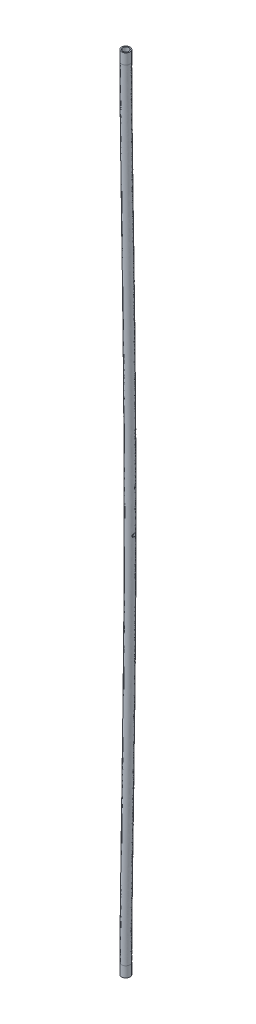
ISO-10303-21;
HEADER;
FILE_DESCRIPTION(('STEP AP214'),'2;1');
FILE_NAME('part.step','',(''),(''),'','','');
FILE_SCHEMA(('AUTOMOTIVE_DESIGN { 1 0 10303 214 1 1 1 1 }'));
ENDSEC;
DATA;
#1=APPLICATION_CONTEXT('core data for automotive mechanical design processes');
#2=APPLICATION_PROTOCOL_DEFINITION('international standard','automotive_design',2000,#1);
#3=PRODUCT_CONTEXT('',#1,'mechanical');
#4=PRODUCT('Part','Part','',(#3));
#5=PRODUCT_RELATED_PRODUCT_CATEGORY('part','',(#4));
#6=PRODUCT_DEFINITION_FORMATION('','',#4);
#7=PRODUCT_DEFINITION_CONTEXT('part definition',#1,'design');
#8=PRODUCT_DEFINITION('design','',#6,#7);
#9=PRODUCT_DEFINITION_SHAPE('','',#8);
#10=(LENGTH_UNIT() NAMED_UNIT(*) SI_UNIT(.MILLI.,.METRE.));
#11=(NAMED_UNIT(*) PLANE_ANGLE_UNIT() SI_UNIT($,.RADIAN.));
#12=(NAMED_UNIT(*) SI_UNIT($,.STERADIAN.) SOLID_ANGLE_UNIT());
#13=UNCERTAINTY_MEASURE_WITH_UNIT(LENGTH_MEASURE(1.E-05),#10,'distance_accuracy_value','');
#14=(GEOMETRIC_REPRESENTATION_CONTEXT(3) GLOBAL_UNCERTAINTY_ASSIGNED_CONTEXT((#13)) GLOBAL_UNIT_ASSIGNED_CONTEXT((#10,
#11,#12)) REPRESENTATION_CONTEXT('',''));
#15=CARTESIAN_POINT('',(0.,0.,0.));
#16=DIRECTION('',(0.,0.,1.));
#17=DIRECTION('',(1.,0.,0.));
#18=AXIS2_PLACEMENT_3D('',#15,#16,#17);
#19=CARTESIAN_POINT('',(0.,10.,4.));
#20=CARTESIAN_POINT('',(0.,28.0561455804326,4.));
#21=CARTESIAN_POINT('',(0.631904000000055,78.4560908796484,4.));
#22=CARTESIAN_POINT('',(2.41387328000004,184.166690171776,4.));
#23=CARTESIAN_POINT('',(3.746288,289.654404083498,4.));
#24=CARTESIAN_POINT('',(4.107376,374.113132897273,4.));
#25=CARTESIAN_POINT('',(3.83011200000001,459.667874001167,4.));
#26=CARTESIAN_POINT('',(2.59375815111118,561.259373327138,4.));
#27=CARTESIAN_POINT('',(0.693518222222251,671.463828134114,4.));
#28=CARTESIAN_POINT('',(0.,727.740513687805,4.));
#29=CARTESIAN_POINT('',(0.,750.,4.));
#30=CARTESIAN_POINT('',(-8.,10.,4.));
#31=CARTESIAN_POINT('',(-8.,28.0561455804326,4.));
#32=CARTESIAN_POINT('',(-7.36680746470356,78.6302533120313,4.));
#33=CARTESIAN_POINT('',(-5.58519706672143,184.279731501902,4.));
#34=CARTESIAN_POINT('',(-4.25349651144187,289.733651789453,4.));
#35=CARTESIAN_POINT('',(-3.89260493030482,374.117214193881,4.));
#36=CARTESIAN_POINT('',(-4.16975421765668,459.596575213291,4.));
#37=CARTESIAN_POINT('',(-5.40528032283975,561.143642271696,4.));
#38=CARTESIAN_POINT('',(-7.30519139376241,671.289707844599,4.));
#39=CARTESIAN_POINT('',(-8.,727.740513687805,4.));
#40=CARTESIAN_POINT('',(-8.,750.,4.));
#41=CARTESIAN_POINT('',(-8.,10.,-4.));
#42=CARTESIAN_POINT('',(-8.,28.0561455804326,-4.));
#43=CARTESIAN_POINT('',(-7.36680746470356,78.6302533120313,-4.));
#44=CARTESIAN_POINT('',(-5.58519706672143,184.279731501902,-4.));
#45=CARTESIAN_POINT('',(-4.25349651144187,289.733651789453,-4.));
#46=CARTESIAN_POINT('',(-3.89260493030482,374.117214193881,-4.));
#47=CARTESIAN_POINT('',(-4.16975421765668,459.596575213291,-4.));
#48=CARTESIAN_POINT('',(-5.40528032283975,561.143642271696,-4.));
#49=CARTESIAN_POINT('',(-7.30519139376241,671.289707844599,-4.));
#50=CARTESIAN_POINT('',(-8.,727.740513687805,-4.));
#51=CARTESIAN_POINT('',(-8.,750.,-4.));
#52=CARTESIAN_POINT('',(0.,10.,-4.));
#53=CARTESIAN_POINT('',(0.,28.0561455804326,-4.));
#54=CARTESIAN_POINT('',(0.631904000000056,78.4560908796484,-4.));
#55=CARTESIAN_POINT('',(2.41387328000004,184.166690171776,-4.));
#56=CARTESIAN_POINT('',(3.746288,289.654404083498,-4.));
#57=CARTESIAN_POINT('',(4.107376,374.113132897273,-4.));
#58=CARTESIAN_POINT('',(3.83011200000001,459.667874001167,-4.));
#59=CARTESIAN_POINT('',(2.59375815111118,561.259373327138,-4.));
#60=CARTESIAN_POINT('',(0.693518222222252,671.463828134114,-4.));
#61=CARTESIAN_POINT('',(0.,727.740513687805,-4.));
#62=CARTESIAN_POINT('',(0.,750.,-4.));
#63=CARTESIAN_POINT('',(8.,10.,-4.));
#64=CARTESIAN_POINT('',(8.,28.0561455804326,-4.));
#65=CARTESIAN_POINT('',(8.63061546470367,78.2819284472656,-4.));
#66=CARTESIAN_POINT('',(10.4129436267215,184.05364884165,-4.));
#67=CARTESIAN_POINT('',(11.7460725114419,289.575156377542,-4.));
#68=CARTESIAN_POINT('',(12.1073569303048,374.109051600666,-4.));
#69=CARTESIAN_POINT('',(11.8299782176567,459.739172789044,-4.));
#70=CARTESIAN_POINT('',(10.5927966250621,561.375104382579,-4.));
#71=CARTESIAN_POINT('',(8.69222783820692,671.637948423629,-4.));
#72=CARTESIAN_POINT('',(8.,727.740513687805,-4.));
#73=CARTESIAN_POINT('',(8.,750.,-4.));
#74=CARTESIAN_POINT('',(8.,10.,4.));
#75=CARTESIAN_POINT('',(8.,28.0561455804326,4.));
#76=CARTESIAN_POINT('',(8.63061546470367,78.2819284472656,4.));
#77=CARTESIAN_POINT('',(10.4129436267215,184.05364884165,4.));
#78=CARTESIAN_POINT('',(11.7460725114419,289.575156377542,4.));
#79=CARTESIAN_POINT('',(12.1073569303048,374.109051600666,4.));
#80=CARTESIAN_POINT('',(11.8299782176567,459.739172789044,4.));
#81=CARTESIAN_POINT('',(10.5927966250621,561.375104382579,4.));
#82=CARTESIAN_POINT('',(8.69222783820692,671.637948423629,4.));
#83=CARTESIAN_POINT('',(8.,727.740513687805,4.));
#84=CARTESIAN_POINT('',(8.,750.,4.));
#85=CARTESIAN_POINT('',(0.,10.,4.));
#86=CARTESIAN_POINT('',(0.,28.0561455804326,4.));
#87=CARTESIAN_POINT('',(0.631904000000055,78.4560908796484,4.));
#88=CARTESIAN_POINT('',(2.41387328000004,184.166690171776,4.));
#89=CARTESIAN_POINT('',(3.746288,289.654404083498,4.));
#90=CARTESIAN_POINT('',(4.107376,374.113132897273,4.));
#91=CARTESIAN_POINT('',(3.83011200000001,459.667874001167,4.));
#92=CARTESIAN_POINT('',(2.59375815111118,561.259373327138,4.));
#93=CARTESIAN_POINT('',(0.693518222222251,671.463828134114,4.));
#94=CARTESIAN_POINT('',(0.,727.740513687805,4.));
#95=CARTESIAN_POINT('',(0.,750.,4.));
#96=(BOUNDED_SURFACE() B_SPLINE_SURFACE(3,3,((#19,#20,#21,#22,#23,#24,#25,#26,#27,#28,#29),(#30,
#31,#32,#33,#34,#35,#36,#37,#38,#39,#40),(#41,#42,#43,#44,#45,#46,#47,#48,#49,#50,#51),(#52,#53,
#54,#55,#56,#57,#58,#59,#60,#61,#62),(#63,#64,#65,#66,#67,#68,#69,#70,#71,#72,#73),(#74,#75,#76,
#77,#78,#79,#80,#81,#82,#83,#84),(#85,#86,#87,#88,#89,#90,#91,#92,#93,#94,#95)),.UNSPECIFIED.,
.T.,.F.,.F.) B_SPLINE_SURFACE_WITH_KNOTS((4,3,4),(4,1,1,1,1,1,1,1,4),(0.,0.5,1.),(0.,
0.140000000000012,0.28,0.42,0.500000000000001,0.56,0.706666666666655,0.853333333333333,1.),
.UNSPECIFIED.) GEOMETRIC_REPRESENTATION_ITEM() RATIONAL_B_SPLINE_SURFACE(((1.,1.,1.,1.,1.,1.,1.,
1.,1.,1.,1.),(0.333333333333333,0.333333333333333,0.333333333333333,0.333333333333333,
0.333333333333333,0.333333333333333,0.333333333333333,0.333333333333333,0.333333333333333,
0.333333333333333,0.333333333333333),(0.333333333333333,0.333333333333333,0.333333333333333,
0.333333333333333,0.333333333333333,0.333333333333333,0.333333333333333,0.333333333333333,
0.333333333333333,0.333333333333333,0.333333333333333),(1.,1.,1.,1.,1.,1.,1.,1.,1.,1.,1.),
(0.333333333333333,0.333333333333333,0.333333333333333,0.333333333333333,0.333333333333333,
0.333333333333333,0.333333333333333,0.333333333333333,0.333333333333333,0.333333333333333,
0.333333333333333),(0.333333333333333,0.333333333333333,0.333333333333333,0.333333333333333,
0.333333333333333,0.333333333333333,0.333333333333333,0.333333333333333,0.333333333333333,
0.333333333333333,0.333333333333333),(1.,1.,1.,1.,1.,1.,1.,1.,1.,1.,1.))) REPRESENTATION_ITEM('') SURFACE());
#97=CARTESIAN_POINT('',(7.61372951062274,365.,1.75));
#98=CARTESIAN_POINT('',(7.61357437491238,364.907205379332,1.74999502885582));
#99=CARTESIAN_POINT('',(7.61705078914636,364.814246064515,1.74257071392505));
#100=CARTESIAN_POINT('',(7.63079581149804,364.631049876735,1.71319310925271));
#101=CARTESIAN_POINT('',(7.64108192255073,364.540820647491,1.69120237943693));
#102=CARTESIAN_POINT('',(7.66703886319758,364.366019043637,1.63370375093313));
#103=CARTESIAN_POINT('',(7.6826863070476,364.281423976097,1.59825448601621));
#104=CARTESIAN_POINT('',(7.7088123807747,364.15998415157,1.53588780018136));
#105=CARTESIAN_POINT('',(7.71796428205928,364.120410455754,1.513564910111));
#106=CARTESIAN_POINT('',(7.73692339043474,364.043189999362,1.46597141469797));
#107=CARTESIAN_POINT('',(7.74673117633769,364.005544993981,1.44069819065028));
#108=CARTESIAN_POINT('',(7.77799331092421,363.891327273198,1.35741370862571));
#109=CARTESIAN_POINT('',(7.80016977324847,363.818461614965,1.29448288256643));
#110=CARTESIAN_POINT('',(7.84403792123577,363.683935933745,1.15745145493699));
#111=CARTESIAN_POINT('',(7.8657295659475,363.622276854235,1.08334991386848));
#112=CARTESIAN_POINT('',(7.89677297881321,363.537974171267,0.963088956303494));
#113=CARTESIAN_POINT('',(7.90709450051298,363.510704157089,0.920363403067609));
#114=CARTESIAN_POINT('',(7.92671333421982,363.45990671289,0.832577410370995));
#115=CARTESIAN_POINT('',(7.93601155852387,363.436375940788,0.787519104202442));
#116=CARTESIAN_POINT('',(7.96196710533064,363.371701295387,0.649208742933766));
#117=CARTESIAN_POINT('',(7.97670758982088,363.33641668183,0.552738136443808));
#118=CARTESIAN_POINT('',(7.99861484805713,363.284673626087,0.359950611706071));
#119=CARTESIAN_POINT('',(8.00615924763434,363.267272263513,0.263927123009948));
#120=CARTESIAN_POINT('',(8.01421896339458,363.248696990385,0.0700336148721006));
#121=CARTESIAN_POINT('',(8.0147374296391,363.247515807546,-0.0278355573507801));
#122=CARTESIAN_POINT('',(8.00889548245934,363.260959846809,-0.21567673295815));
#123=CARTESIAN_POINT('',(8.00299057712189,363.274538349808,-0.305740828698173));
#124=CARTESIAN_POINT('',(7.98560903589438,363.315299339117,-0.48216336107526));
#125=CARTESIAN_POINT('',(7.97413198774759,363.342482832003,-0.568521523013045));
#126=CARTESIAN_POINT('',(7.94648614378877,363.409979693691,-0.736661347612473));
#127=CARTESIAN_POINT('',(7.93024914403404,363.450485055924,-0.818354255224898));
#128=CARTESIAN_POINT('',(7.89464707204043,363.543276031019,-0.973998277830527));
#129=CARTESIAN_POINT('',(7.87528086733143,363.595565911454,-1.04794657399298));
#130=CARTESIAN_POINT('',(7.83360456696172,363.715052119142,-1.19198008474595));
#131=CARTESIAN_POINT('',(7.81118259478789,363.783079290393,-1.26134462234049));
#132=CARTESIAN_POINT('',(7.76700035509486,363.929803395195,-1.38801273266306));
#133=CARTESIAN_POINT('',(7.74524039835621,364.008505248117,-1.44531071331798));
#134=CARTESIAN_POINT('',(7.7040163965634,364.178164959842,-1.54832399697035));
#135=CARTESIAN_POINT('',(7.68467382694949,364.269479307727,-1.59350509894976));
#136=CARTESIAN_POINT('',(7.65196753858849,364.459487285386,-1.66754904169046));
#137=CARTESIAN_POINT('',(7.63859902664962,364.558174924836,-1.69642496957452));
#138=CARTESIAN_POINT('',(7.62057238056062,364.752829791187,-1.73509603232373));
#139=CARTESIAN_POINT('',(7.6153740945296,364.848510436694,-1.7460763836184));
#140=CARTESIAN_POINT('',(7.61274944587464,365.040464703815,-1.75216224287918));
#141=CARTESIAN_POINT('',(7.61531994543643,365.136738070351,-1.7472741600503));
#142=CARTESIAN_POINT('',(7.62738525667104,365.319709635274,-1.72284148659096));
#143=CARTESIAN_POINT('',(7.63636007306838,365.406593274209,-1.70439460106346));
#144=CARTESIAN_POINT('',(7.65955703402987,365.57593758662,-1.65486619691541));
#145=CARTESIAN_POINT('',(7.67378050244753,365.658397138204,-1.62378149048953));
#146=CARTESIAN_POINT('',(7.706652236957,365.820684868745,-1.54833648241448));
#147=CARTESIAN_POINT('',(7.72547028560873,365.900229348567,-1.50344349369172));
#148=CARTESIAN_POINT('',(7.7652056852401,366.051088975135,-1.40212990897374));
#149=CARTESIAN_POINT('',(7.78612404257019,366.122400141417,-1.34570377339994));
#150=CARTESIAN_POINT('',(7.81854929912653,366.225199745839,-1.25053543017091));
#151=CARTESIAN_POINT('',(7.83002232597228,366.260082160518,-1.2153777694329));
#152=CARTESIAN_POINT('',(7.8526882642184,366.326752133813,-1.14222447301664));
#153=CARTESIAN_POINT('',(7.86388142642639,366.358542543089,-1.10423150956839));
#154=CARTESIAN_POINT('',(7.89661584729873,366.449037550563,-0.986207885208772));
#155=CARTESIAN_POINT('',(7.91731862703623,366.502885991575,-0.902113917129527));
#156=CARTESIAN_POINT('',(7.95433425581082,366.596090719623,-0.724644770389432));
#157=CARTESIAN_POINT('',(7.97061776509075,366.63535075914,-0.631212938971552));
#158=CARTESIAN_POINT('',(7.99674548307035,366.697284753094,-0.438151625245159));
#159=CARTESIAN_POINT('',(8.00659400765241,366.719969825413,-0.338526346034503));
#160=CARTESIAN_POINT('',(8.01819971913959,366.746601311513,-0.14411618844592));
#161=CARTESIAN_POINT('',(8.0205163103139,366.751843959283,-0.0495409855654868));
#162=CARTESIAN_POINT('',(8.01839384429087,366.747009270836,0.139129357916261));
#163=CARTESIAN_POINT('',(8.01395620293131,366.736935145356,0.233224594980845));
#164=CARTESIAN_POINT('',(7.99913010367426,366.702677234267,0.414140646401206));
#165=CARTESIAN_POINT('',(7.98900095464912,366.679107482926,0.50110084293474));
#166=CARTESIAN_POINT('',(7.96395473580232,366.619233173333,0.669774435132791));
#167=CARTESIAN_POINT('',(7.94903680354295,366.582926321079,0.751486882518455));
#168=CARTESIAN_POINT('',(7.91497507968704,366.496762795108,0.911501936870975));
#169=CARTESIAN_POINT('',(7.89566845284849,366.446359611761,0.989474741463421));
#170=CARTESIAN_POINT('',(7.85505594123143,366.334201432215,1.13619698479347));
#171=CARTESIAN_POINT('',(7.833749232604,366.272441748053,1.20494259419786));
#172=CARTESIAN_POINT('',(7.78945522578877,366.133760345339,1.33675771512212));
#173=CARTESIAN_POINT('',(7.76646424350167,366.056039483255,1.39898875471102));
#174=CARTESIAN_POINT('',(7.72299198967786,365.890643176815,1.50969249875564));
#175=CARTESIAN_POINT('',(7.70251226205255,365.802961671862,1.55815676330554));
#176=CARTESIAN_POINT('',(7.66662242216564,365.619436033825,1.63977767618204));
#177=CARTESIAN_POINT('',(7.65122185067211,365.523576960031,1.67290556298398));
#178=CARTESIAN_POINT('',(7.63366004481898,365.376199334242,1.70983795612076));
#179=CARTESIAN_POINT('',(7.62873132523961,365.326523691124,1.72001858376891));
#180=CARTESIAN_POINT('',(7.62088720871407,365.226332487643,1.73604131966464));
#181=CARTESIAN_POINT('',(7.6179702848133,365.175817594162,1.74188671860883));
#182=CARTESIAN_POINT('',(7.61536113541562,365.104313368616,1.74701310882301));
#183=CARTESIAN_POINT('',(7.61478159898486,365.083471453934,1.74813250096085));
#184=CARTESIAN_POINT('',(7.61398323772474,365.041755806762,1.74962651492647));
#185=CARTESIAN_POINT('',(7.6137644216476,365.020882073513,1.75000111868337));
#186=CARTESIAN_POINT('',(7.61372951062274,365.,1.75));
#187=B_SPLINE_CURVE_WITH_KNOTS('',3,(#97,#98,#99,#100,#101,#102,#103,#104,#105,#106,#107,#108,
#109,#110,#111,#112,#113,#114,#115,#116,#117,#118,#119,#120,#121,#122,#123,#124,#125,#126,#127,
#128,#129,#130,#131,#132,#133,#134,#135,#136,#137,#138,#139,#140,#141,#142,#143,#144,#145,#146,
#147,#148,#149,#150,#151,#152,#153,#154,#155,#156,#157,#158,#159,#160,#161,#162,#163,#164,#165,
#166,#167,#168,#169,#170,#171,#172,#173,#174,#175,#176,#177,#178,#179,#180,#181,#182,#183,#184,
#185,#186),.UNSPECIFIED.,.T.,.F.,(4,2,2,2,2,2,2,2,2,2,2,2,2,2,2,2,2,2,2,2,2,2,2,2,2,2,2,2,2,2,2,
2,2,2,2,2,2,2,2,2,2,2,2,2,4),(0.,0.278299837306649,0.557317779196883,0.835133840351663,
0.974061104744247,1.11311263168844,1.40815937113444,1.70323093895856,1.85823243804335,
2.01309461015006,2.32251129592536,2.61461505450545,2.90658784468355,3.1791292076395,
3.45169073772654,3.72836640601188,4.00514242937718,4.30295265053,4.60090058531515,
4.91038164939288,5.21961395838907,5.50738377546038,5.79503737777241,6.06165986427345,
6.32834964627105,6.60699548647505,6.8857754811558,7.03813305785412,7.19034881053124,
7.49469698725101,7.80101888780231,8.10713512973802,8.38992395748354,8.67265351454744,
8.94343929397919,9.21427386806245,9.4975679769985,9.78097929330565,10.0861054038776,
10.3914181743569,10.697301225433,10.8499558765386,11.0024945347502,11.0651203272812,
11.1277476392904),.UNSPECIFIED.);
#188=CARTESIAN_POINT('',(7.61372951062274,365.,1.75));
#189=VERTEX_POINT('',#188);
#190=EDGE_CURVE('E87',#189,#189,#187,.T.);
#191=CARTESIAN_POINT('',(0.,10.,0.));
#192=DIRECTION('',(0.,1.,0.));
#193=DIRECTION('',(0.,0.,1.));
#194=AXIS2_PLACEMENT_3D('',#191,#192,#193);
#195=CIRCLE('',#194,4.);
#196=CARTESIAN_POINT('',(0.,10.,4.));
#197=VERTEX_POINT('',#196);
#198=EDGE_CURVE('E172',#197,#197,#195,.T.);
#199=CARTESIAN_POINT('',(0.,750.,0.));
#200=DIRECTION('',(0.,1.,0.));
#201=DIRECTION('',(0.,0.,1.));
#202=AXIS2_PLACEMENT_3D('',#199,#200,#201);
#203=CIRCLE('',#202,4.);
#204=CARTESIAN_POINT('',(0.,750.,4.));
#205=VERTEX_POINT('',#204);
#206=EDGE_CURVE('E176',#205,#205,#203,.T.);
#207=CARTESIAN_POINT('',(0.420022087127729,365.,1.75));
#208=CARTESIAN_POINT('',(0.420177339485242,365.092787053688,1.74999501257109));
#209=CARTESIAN_POINT('',(0.416698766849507,365.185738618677,1.74257191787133));
#210=CARTESIAN_POINT('',(0.402945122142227,365.368919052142,1.71319935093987));
#211=CARTESIAN_POINT('',(0.392652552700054,365.459140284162,1.69121248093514));
#212=CARTESIAN_POINT('',(0.366679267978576,365.63392582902,1.63372461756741));
#213=CARTESIAN_POINT('',(0.351021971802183,365.718512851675,1.59828229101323));
#214=CARTESIAN_POINT('',(0.324879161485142,365.839941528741,1.53592828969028));
#215=CARTESIAN_POINT('',(0.315721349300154,365.879511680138,1.51360999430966));
#216=CARTESIAN_POINT('',(0.296749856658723,365.956725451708,1.46602642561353));
#217=CARTESIAN_POINT('',(0.286935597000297,365.99436731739,1.44075853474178));
#218=CARTESIAN_POINT('',(0.255650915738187,366.108581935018,1.35748752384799));
#219=CARTESIAN_POINT('',(0.233457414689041,366.181447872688,1.29456509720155));
#220=CARTESIAN_POINT('',(0.189554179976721,366.315976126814,1.15755100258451));
#221=CARTESIAN_POINT('',(0.16784448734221,366.37763749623,1.08345839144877));
#222=CARTESIAN_POINT('',(0.136772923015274,366.461948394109,0.963206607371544));
#223=CARTESIAN_POINT('',(0.126441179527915,366.489223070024,0.920481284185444));
#224=CARTESIAN_POINT('',(0.106802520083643,366.540029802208,0.832694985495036));
#225=CARTESIAN_POINT('',(0.097494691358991,366.563565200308,0.787636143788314));
#226=CARTESIAN_POINT('',(0.0715117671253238,366.628253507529,0.649322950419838));
#227=CARTESIAN_POINT('',(0.056754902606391,366.663547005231,0.552848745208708));
#228=CARTESIAN_POINT('',(0.03482279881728,366.715303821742,0.360057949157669));
#229=CARTESIAN_POINT('',(0.0272691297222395,366.732711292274,0.264035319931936));
#230=CARTESIAN_POINT('',(0.0191970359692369,366.751298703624,0.0701418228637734));
#231=CARTESIAN_POINT('',(0.0186754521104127,366.752485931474,-0.0277281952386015));
#232=CARTESIAN_POINT('',(0.0245173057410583,366.739054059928,-0.215559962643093));
#233=CARTESIAN_POINT('',(0.0304240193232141,366.725483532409,-0.305613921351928));
#234=CARTESIAN_POINT('',(0.0478129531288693,366.684741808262,-0.482017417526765));
#235=CARTESIAN_POINT('',(0.0592955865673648,366.657569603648,-0.5683666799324));
#236=CARTESIAN_POINT('',(0.0869559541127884,366.590098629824,-0.736490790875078));
#237=CARTESIAN_POINT('',(0.103201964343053,366.54960784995,-0.818176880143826));
#238=CARTESIAN_POINT('',(0.138824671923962,366.45684908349,-0.973809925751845));
#239=CARTESIAN_POINT('',(0.158202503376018,366.404576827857,-1.04775406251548));
#240=CARTESIAN_POINT('',(0.199907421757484,366.285123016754,-1.19179091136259));
#241=CARTESIAN_POINT('',(0.222346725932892,366.217109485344,-1.26116209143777));
#242=CARTESIAN_POINT('',(0.266565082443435,366.070412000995,-1.38784629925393));
#243=CARTESIAN_POINT('',(0.288343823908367,365.991723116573,-1.44515372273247));
#244=CARTESIAN_POINT('',(0.329608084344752,365.822079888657,-1.5481943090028));
#245=CARTESIAN_POINT('',(0.348971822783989,365.730768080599,-1.59339204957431));
#246=CARTESIAN_POINT('',(0.381717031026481,365.540760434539,-1.66746907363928));
#247=CARTESIAN_POINT('',(0.395103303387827,365.442070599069,-1.69636146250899));
#248=CARTESIAN_POINT('',(0.413157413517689,365.247413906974,-1.73506129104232));
#249=CARTESIAN_POINT('',(0.418366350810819,365.151734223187,-1.74605519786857));
#250=CARTESIAN_POINT('',(0.421006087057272,364.959778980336,-1.75216789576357));
#251=CARTESIAN_POINT('',(0.418440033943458,364.863503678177,-1.74729311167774));
#252=CARTESIAN_POINT('',(0.4063776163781,364.680539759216,-1.72288712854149));
#253=CARTESIAN_POINT('',(0.397402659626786,364.593665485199,-1.70445565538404));
#254=CARTESIAN_POINT('',(0.374201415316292,364.424337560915,-1.6549612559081));
#255=CARTESIAN_POINT('',(0.35997380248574,364.341885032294,-1.62389514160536));
#256=CARTESIAN_POINT('',(0.327089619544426,364.179608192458,-1.54849098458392));
#257=CARTESIAN_POINT('',(0.308263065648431,364.100067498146,-1.50362030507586));
#258=CARTESIAN_POINT('',(0.268506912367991,363.949211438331,-1.40235411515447));
#259=CARTESIAN_POINT('',(0.247576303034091,363.877900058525,-1.34595305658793));
#260=CARTESIAN_POINT('',(0.215128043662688,363.775091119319,-1.25082026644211));
#261=CARTESIAN_POINT('',(0.203645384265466,363.7402017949,-1.21567202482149));
#262=CARTESIAN_POINT('',(0.180959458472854,363.673517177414,-1.14253713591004));
#263=CARTESIAN_POINT('',(0.169755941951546,363.641719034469,-1.10455316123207));
#264=CARTESIAN_POINT('',(0.136989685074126,363.55119937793,-0.986555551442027));
#265=CARTESIAN_POINT('',(0.116264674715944,363.497332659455,-0.902477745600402));
#266=CARTESIAN_POINT('',(0.0792029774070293,363.404083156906,-0.725028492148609));
#267=CARTESIAN_POINT('',(0.0628960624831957,363.364798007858,-0.631599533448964));
#268=CARTESIAN_POINT('',(0.0367259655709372,363.30281445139,-0.438537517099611));
#269=CARTESIAN_POINT('',(0.026858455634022,363.280104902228,-0.338908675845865));
#270=CARTESIAN_POINT('',(0.0152238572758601,363.253430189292,-0.144496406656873));
#271=CARTESIAN_POINT('',(0.0128961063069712,363.248166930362,-0.049923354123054));
#272=CARTESIAN_POINT('',(0.0150023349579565,363.252960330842,0.138746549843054));
#273=CARTESIAN_POINT('',(0.0194348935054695,363.263013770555,0.232843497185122));
#274=CARTESIAN_POINT('',(0.0342563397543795,363.297229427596,0.413753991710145));
#275=CARTESIAN_POINT('',(0.0443848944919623,363.320775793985,0.500707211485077));
#276=CARTESIAN_POINT('',(0.0694341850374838,363.380600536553,0.669370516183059));
#277=CARTESIAN_POINT('',(0.0843557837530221,363.416881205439,0.751079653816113));
#278=CARTESIAN_POINT('',(0.118429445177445,363.502989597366,0.911093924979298));
#279=CARTESIAN_POINT('',(0.13774461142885,363.553363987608,0.989069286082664));
#280=CARTESIAN_POINT('',(0.178378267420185,363.665462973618,1.13580165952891));
#281=CARTESIAN_POINT('',(0.199697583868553,363.727192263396,1.20455483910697));
#282=CARTESIAN_POINT('',(0.244024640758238,363.865819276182,1.33640082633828));
#283=CARTESIAN_POINT('',(0.267036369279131,363.943517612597,1.39865404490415));
#284=CARTESIAN_POINT('',(0.310552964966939,364.10887249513,1.50940642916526));
#285=CARTESIAN_POINT('',(0.331056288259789,364.196535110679,1.55789714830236));
#286=CARTESIAN_POINT('',(0.366995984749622,364.380037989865,1.63957932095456));
#287=CARTESIAN_POINT('',(0.382422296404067,364.475894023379,1.67274044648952));
#288=CARTESIAN_POINT('',(0.400019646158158,364.623273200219,1.70972194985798));
#289=CARTESIAN_POINT('',(0.40495969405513,364.672950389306,1.71991880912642));
#290=CARTESIAN_POINT('',(0.412824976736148,364.773146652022,1.73597348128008));
#291=CARTESIAN_POINT('',(0.41575173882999,364.823665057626,1.74183458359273));
#292=CARTESIAN_POINT('',(0.418376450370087,364.89525867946,1.74698852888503));
#293=CARTESIAN_POINT('',(0.418961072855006,364.916185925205,1.74811713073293));
#294=CARTESIAN_POINT('',(0.419766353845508,364.958072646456,1.74962343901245));
#295=CARTESIAN_POINT('',(0.419987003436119,364.979032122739,1.7500011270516));
#296=CARTESIAN_POINT('',(0.420022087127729,365.,1.75));
#297=B_SPLINE_CURVE_WITH_KNOTS('',3,(#207,#208,#209,#210,#211,#212,#213,#214,#215,#216,#217,
#218,#219,#220,#221,#222,#223,#224,#225,#226,#227,#228,#229,#230,#231,#232,#233,#234,#235,#236,
#237,#238,#239,#240,#241,#242,#243,#244,#245,#246,#247,#248,#249,#250,#251,#252,#253,#254,#255,
#256,#257,#258,#259,#260,#261,#262,#263,#264,#265,#266,#267,#268,#269,#270,#271,#272,#273,#274,
#275,#276,#277,#278,#279,#280,#281,#282,#283,#284,#285,#286,#287,#288,#289,#290,#291,#292,#293,
#294,#295,#296),.UNSPECIFIED.,.T.,.F.,(4,2,2,2,2,2,2,2,2,2,2,2,2,2,2,2,2,2,2,2,2,2,2,2,2,2,2,2,
2,2,2,2,2,2,2,2,2,2,2,2,2,2,2,2,4),(0.,0.278276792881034,0.557270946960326,0.835062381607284,
0.973977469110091,1.1130167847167,1.408059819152,1.70312777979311,1.85814216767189,
2.01301722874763,2.32245937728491,2.61456564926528,2.90654068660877,3.17904898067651,
3.45157747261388,3.72822103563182,4.00496500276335,4.30277307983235,4.60071920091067,
4.91022689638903,5.21948547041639,5.50725835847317,5.79491474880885,6.06150054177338,
6.32815364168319,6.60676310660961,6.88550694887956,7.03786575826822,7.19008274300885,
7.49443375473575,7.8007873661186,8.10693486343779,8.3897211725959,8.67244804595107,
8.94319551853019,9.21399176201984,9.49725186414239,9.78062932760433,10.0857588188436,
10.3910751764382,10.6969930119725,10.8496651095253,11.0022212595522,11.0651042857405,
11.1279888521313),.UNSPECIFIED.);
#298=CARTESIAN_POINT('',(0.420022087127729,365.,1.75));
#299=VERTEX_POINT('',#298);
#300=EDGE_CURVE('E11',#299,#299,#297,.T.);
#301=ORIENTED_EDGE('',*,*,#190,.F.);
#302=EDGE_LOOP('',(#301));
#303=FACE_BOUND('',#302,.T.);
#304=ORIENTED_EDGE('',*,*,#198,.T.);
#305=EDGE_LOOP('',(#304));
#306=FACE_BOUND('',#305,.T.);
#307=ORIENTED_EDGE('',*,*,#206,.F.);
#308=EDGE_LOOP('',(#307));
#309=FACE_BOUND('',#308,.T.);
#310=ORIENTED_EDGE('',*,*,#300,.F.);
#311=EDGE_LOOP('',(#310));
#312=FACE_BOUND('',#311,.T.);
#313=ADVANCED_FACE('F75',(#303,#306,#309,#312),#96,.F.);
#314=CARTESIAN_POINT('',(0.,10.,3.));
#315=CARTESIAN_POINT('',(0.,28.0561455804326,3.));
#316=CARTESIAN_POINT('',(0.631904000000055,78.4560908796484,3.));
#317=CARTESIAN_POINT('',(2.41387328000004,184.166690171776,3.));
#318=CARTESIAN_POINT('',(3.746288,289.654404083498,3.));
#319=CARTESIAN_POINT('',(4.107376,374.113132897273,3.));
#320=CARTESIAN_POINT('',(3.83011200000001,459.667874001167,3.));
#321=CARTESIAN_POINT('',(2.59375815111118,561.259373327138,3.));
#322=CARTESIAN_POINT('',(0.693518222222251,671.463828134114,3.));
#323=CARTESIAN_POINT('',(0.,727.740513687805,3.));
#324=CARTESIAN_POINT('',(0.,750.,3.));
#325=CARTESIAN_POINT('',(-6.,10.,3.));
#326=CARTESIAN_POINT('',(-6.,28.0561455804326,3.));
#327=CARTESIAN_POINT('',(-5.36712959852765,78.5867127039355,3.));
#328=CARTESIAN_POINT('',(-3.58542948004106,184.25147116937,3.));
#329=CARTESIAN_POINT('',(-2.2535503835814,289.713839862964,3.));
#330=CARTESIAN_POINT('',(-1.89260969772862,374.116193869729,3.));
#331=CARTESIAN_POINT('',(-2.16978766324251,459.61439991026,3.));
#332=CARTESIAN_POINT('',(-3.40552070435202,561.172575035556,3.));
#333=CARTESIAN_POINT('',(-5.30551398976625,671.333237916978,3.));
#334=CARTESIAN_POINT('',(-6.,727.740513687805,3.));
#335=CARTESIAN_POINT('',(-6.,750.,3.));
#336=CARTESIAN_POINT('',(-6.,10.,-3.));
#337=CARTESIAN_POINT('',(-6.,28.0561455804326,-3.));
#338=CARTESIAN_POINT('',(-5.36712959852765,78.5867127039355,-3.));
#339=CARTESIAN_POINT('',(-3.58542948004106,184.25147116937,-3.));
#340=CARTESIAN_POINT('',(-2.2535503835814,289.713839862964,-3.));
#341=CARTESIAN_POINT('',(-1.89260969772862,374.116193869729,-3.));
#342=CARTESIAN_POINT('',(-2.16978766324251,459.61439991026,-3.));
#343=CARTESIAN_POINT('',(-3.40552070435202,561.172575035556,-3.));
#344=CARTESIAN_POINT('',(-5.30551398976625,671.333237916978,-3.));
#345=CARTESIAN_POINT('',(-6.,727.740513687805,-3.));
#346=CARTESIAN_POINT('',(-6.,750.,-3.));
#347=CARTESIAN_POINT('',(0.,10.,-3.));
#348=CARTESIAN_POINT('',(0.,28.0561455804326,-3.));
#349=CARTESIAN_POINT('',(0.631904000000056,78.4560908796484,-3.));
#350=CARTESIAN_POINT('',(2.41387328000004,184.166690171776,-3.));
#351=CARTESIAN_POINT('',(3.746288,289.654404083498,-3.));
#352=CARTESIAN_POINT('',(4.107376,374.113132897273,-3.));
#353=CARTESIAN_POINT('',(3.83011200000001,459.667874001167,-3.));
#354=CARTESIAN_POINT('',(2.59375815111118,561.259373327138,-3.));
#355=CARTESIAN_POINT('',(0.693518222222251,671.463828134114,-3.));
#356=CARTESIAN_POINT('',(0.,727.740513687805,-3.));
#357=CARTESIAN_POINT('',(0.,750.,-3.));
#358=CARTESIAN_POINT('',(6.,10.,-3.));
#359=CARTESIAN_POINT('',(6.,28.0561455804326,-3.));
#360=CARTESIAN_POINT('',(6.63093759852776,78.3254690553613,-3.));
#361=CARTESIAN_POINT('',(8.41317604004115,184.081909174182,-3.));
#362=CARTESIAN_POINT('',(9.7461263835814,289.594968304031,-3.));
#363=CARTESIAN_POINT('',(10.1073616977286,374.110071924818,-3.));
#364=CARTESIAN_POINT('',(9.83001166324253,459.721348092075,-3.));
#365=CARTESIAN_POINT('',(8.59303700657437,561.346171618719,-3.));
#366=CARTESIAN_POINT('',(6.69255043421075,671.59441835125,-3.));
#367=CARTESIAN_POINT('',(6.,727.740513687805,-3.));
#368=CARTESIAN_POINT('',(6.,750.,-3.));
#369=CARTESIAN_POINT('',(6.,10.,3.));
#370=CARTESIAN_POINT('',(6.,28.0561455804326,3.));
#371=CARTESIAN_POINT('',(6.63093759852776,78.3254690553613,3.));
#372=CARTESIAN_POINT('',(8.41317604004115,184.081909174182,3.));
#373=CARTESIAN_POINT('',(9.7461263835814,289.594968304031,3.));
#374=CARTESIAN_POINT('',(10.1073616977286,374.110071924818,3.));
#375=CARTESIAN_POINT('',(9.83001166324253,459.721348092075,3.));
#376=CARTESIAN_POINT('',(8.59303700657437,561.346171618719,3.));
#377=CARTESIAN_POINT('',(6.69255043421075,671.59441835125,3.));
#378=CARTESIAN_POINT('',(6.,727.740513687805,3.));
#379=CARTESIAN_POINT('',(6.,750.,3.));
#380=CARTESIAN_POINT('',(0.,10.,3.));
#381=CARTESIAN_POINT('',(0.,28.0561455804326,3.));
#382=CARTESIAN_POINT('',(0.631904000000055,78.4560908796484,3.));
#383=CARTESIAN_POINT('',(2.41387328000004,184.166690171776,3.));
#384=CARTESIAN_POINT('',(3.746288,289.654404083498,3.));
#385=CARTESIAN_POINT('',(4.107376,374.113132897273,3.));
#386=CARTESIAN_POINT('',(3.83011200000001,459.667874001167,3.));
#387=CARTESIAN_POINT('',(2.59375815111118,561.259373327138,3.));
#388=CARTESIAN_POINT('',(0.693518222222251,671.463828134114,3.));
#389=CARTESIAN_POINT('',(0.,727.740513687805,3.));
#390=CARTESIAN_POINT('',(0.,750.,3.));
#391=(BOUNDED_SURFACE() B_SPLINE_SURFACE(3,3,((#314,#315,#316,#317,#318,#319,#320,#321,#322,
#323,#324),(#325,#326,#327,#328,#329,#330,#331,#332,#333,#334,#335),(#336,#337,#338,#339,#340,
#341,#342,#343,#344,#345,#346),(#347,#348,#349,#350,#351,#352,#353,#354,#355,#356,#357),(#358,
#359,#360,#361,#362,#363,#364,#365,#366,#367,#368),(#369,#370,#371,#372,#373,#374,#375,#376,
#377,#378,#379),(#380,#381,#382,#383,#384,#385,#386,#387,#388,#389,#390)),.UNSPECIFIED.,.T.,.F.,
.F.) B_SPLINE_SURFACE_WITH_KNOTS((4,3,4),(4,1,1,1,1,1,1,1,4),(0.,0.5,1.),(0.,0.140000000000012,
0.28,0.42,0.500000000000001,0.56,0.706666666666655,0.853333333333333,1.),
.UNSPECIFIED.) GEOMETRIC_REPRESENTATION_ITEM() RATIONAL_B_SPLINE_SURFACE(((1.,1.,1.,1.,1.,1.,1.,
1.,1.,1.,1.),(0.333333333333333,0.333333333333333,0.333333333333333,0.333333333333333,
0.333333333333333,0.333333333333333,0.333333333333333,0.333333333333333,0.333333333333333,
0.333333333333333,0.333333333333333),(0.333333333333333,0.333333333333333,0.333333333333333,
0.333333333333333,0.333333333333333,0.333333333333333,0.333333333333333,0.333333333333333,
0.333333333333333,0.333333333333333,0.333333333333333),(1.,1.,1.,1.,1.,1.,1.,1.,1.,1.,1.),
(0.333333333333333,0.333333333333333,0.333333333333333,0.333333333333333,0.333333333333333,
0.333333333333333,0.333333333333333,0.333333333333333,0.333333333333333,0.333333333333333,
0.333333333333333),(0.333333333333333,0.333333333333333,0.333333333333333,0.333333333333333,
0.333333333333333,0.333333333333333,0.333333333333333,0.333333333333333,0.333333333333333,
0.333333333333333,0.333333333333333),(1.,1.,1.,1.,1.,1.,1.,1.,1.,1.,1.))) REPRESENTATION_ITEM('') SURFACE());
#392=CARTESIAN_POINT('',(6.45356088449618,365.,1.75));
#393=CARTESIAN_POINT('',(6.45340738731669,364.911415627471,1.75000046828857));
#394=CARTESIAN_POINT('',(6.45815655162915,364.822824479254,1.74323228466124));
#395=CARTESIAN_POINT('',(6.47662887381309,364.648564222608,1.71661888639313));
#396=CARTESIAN_POINT('',(6.4903612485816,364.562898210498,1.69676024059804));
#397=CARTESIAN_POINT('',(6.52461248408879,364.397365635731,1.6452375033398));
#398=CARTESIAN_POINT('',(6.545085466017,364.31746420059,1.61365304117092));
#399=CARTESIAN_POINT('',(6.59041422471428,364.16413040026,1.53982837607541));
#400=CARTESIAN_POINT('',(6.61527140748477,364.090700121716,1.4975847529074));
#401=CARTESIAN_POINT('',(6.66999868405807,363.943179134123,1.39800876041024));
#402=CARTESIAN_POINT('',(6.7001170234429,363.869971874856,1.33950377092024));
#403=CARTESIAN_POINT('',(6.76000406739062,363.733676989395,1.21147667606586));
#404=CARTESIAN_POINT('',(6.78977251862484,363.670596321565,1.14194705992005));
#405=CARTESIAN_POINT('',(6.84915663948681,363.550077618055,0.985359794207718));
#406=CARTESIAN_POINT('',(6.87845592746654,363.493844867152,0.897242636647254));
#407=CARTESIAN_POINT('',(6.93013246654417,363.39741324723,0.710775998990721));
#408=CARTESIAN_POINT('',(6.95251561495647,363.357200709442,0.612435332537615));
#409=CARTESIAN_POINT('',(6.98602690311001,363.297817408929,0.41770505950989));
#410=CARTESIAN_POINT('',(6.99798947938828,363.277073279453,0.321942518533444));
#411=CARTESIAN_POINT('',(7.01253156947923,363.251919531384,0.127622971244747));
#412=CARTESIAN_POINT('',(7.01511927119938,363.247495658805,0.0290684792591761));
#413=CARTESIAN_POINT('',(7.01089204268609,363.254775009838,-0.155626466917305));
#414=CARTESIAN_POINT('',(7.00514088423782,363.264653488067,-0.241871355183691));
#415=CARTESIAN_POINT('',(6.98665806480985,363.296820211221,-0.411226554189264));
#416=CARTESIAN_POINT('',(6.97392589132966,363.31910936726,-0.4943366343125));
#417=CARTESIAN_POINT('',(6.94247552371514,363.375326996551,-0.655989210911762));
#418=CARTESIAN_POINT('',(6.92371360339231,363.409340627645,-0.73449322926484));
#419=CARTESIAN_POINT('',(6.88173855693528,363.487773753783,-0.884796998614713));
#420=CARTESIAN_POINT('',(6.8585241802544,363.532196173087,-0.956594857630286));
#421=CARTESIAN_POINT('',(6.80650013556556,363.635975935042,-1.10030678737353));
#422=CARTESIAN_POINT('',(6.77735397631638,363.696464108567,-1.17128190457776));
#423=CARTESIAN_POINT('',(6.7181411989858,363.827736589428,-1.30266592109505));
#424=CARTESIAN_POINT('',(6.68807345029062,363.898533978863,-1.36306117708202));
#425=CARTESIAN_POINT('',(6.6267431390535,364.057313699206,-1.4779841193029));
#426=CARTESIAN_POINT('',(6.59568941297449,364.146321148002,-1.53121973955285));
#427=CARTESIAN_POINT('',(6.54018931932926,364.333991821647,-1.62164427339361));
#428=CARTESIAN_POINT('',(6.51573101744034,364.432637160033,-1.65886224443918));
#429=CARTESIAN_POINT('',(6.48226632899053,364.612793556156,-1.70854373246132));
#430=CARTESIAN_POINT('',(6.47097365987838,364.692840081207,-1.72477983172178));
#431=CARTESIAN_POINT('',(6.45628301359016,364.855098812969,-1.74590321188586));
#432=CARTESIAN_POINT('',(6.45287684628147,364.937308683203,-1.75080226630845));
#433=CARTESIAN_POINT('',(6.45446724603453,365.101580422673,-1.74898167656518));
#434=CARTESIAN_POINT('',(6.45947099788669,365.183642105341,-1.74225209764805));
#435=CARTESIAN_POINT('',(6.47716889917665,365.345220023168,-1.71756073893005));
#436=CARTESIAN_POINT('',(6.48986889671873,365.424734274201,-1.69959041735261));
#437=CARTESIAN_POINT('',(6.52145191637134,365.579988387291,-1.65309998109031));
#438=CARTESIAN_POINT('',(6.54038390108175,365.655692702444,-1.62449608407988));
#439=CARTESIAN_POINT('',(6.58239070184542,365.80150271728,-1.55773293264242));
#440=CARTESIAN_POINT('',(6.60546715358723,365.87160619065,-1.519569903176));
#441=CARTESIAN_POINT('',(6.65797832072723,366.017051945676,-1.42715001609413));
#442=CARTESIAN_POINT('',(6.68782261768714,366.091205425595,-1.3712515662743));
#443=CARTESIAN_POINT('',(6.74763807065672,366.229804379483,-1.24846473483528));
#444=CARTESIAN_POINT('',(6.7776093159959,366.294241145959,-1.18156660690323));
#445=CARTESIAN_POINT('',(6.83826746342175,366.418776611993,-1.02968656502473));
#446=CARTESIAN_POINT('',(6.86866104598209,366.477588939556,-0.943519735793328));
#447=CARTESIAN_POINT('',(6.92301253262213,366.579569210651,-0.760529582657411));
#448=CARTESIAN_POINT('',(6.94697531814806,366.622749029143,-0.663714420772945));
#449=CARTESIAN_POINT('',(6.98405468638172,366.688508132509,-0.470149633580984));
#450=CARTESIAN_POINT('',(6.99788021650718,366.712448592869,-0.374002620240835));
#451=CARTESIAN_POINT('',(7.01601360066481,366.743716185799,-0.178197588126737));
#452=CARTESIAN_POINT('',(7.02033086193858,366.751059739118,-0.07854313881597));
#453=CARTESIAN_POINT('',(7.01903367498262,366.74883658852,0.108090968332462));
#454=CARTESIAN_POINT('',(7.01458380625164,366.741252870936,0.195110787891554));
#455=CARTESIAN_POINT('',(6.99844044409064,366.713412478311,0.366393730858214));
#456=CARTESIAN_POINT('',(6.98674666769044,366.693155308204,0.450656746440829));
#457=CARTESIAN_POINT('',(6.9572397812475,366.641038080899,0.613840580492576));
#458=CARTESIAN_POINT('',(6.93945851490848,366.609238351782,0.692786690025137));
#459=CARTESIAN_POINT('',(6.89919548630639,366.535185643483,0.84428771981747));
#460=CARTESIAN_POINT('',(6.8767125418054,366.492930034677,0.916841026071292));
#461=CARTESIAN_POINT('',(6.8260270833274,366.393918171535,1.06209611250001));
#462=CARTESIAN_POINT('',(6.79746727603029,366.336076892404,1.13393253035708));
#463=CARTESIAN_POINT('',(6.73895839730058,366.210162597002,1.26745550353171));
#464=CARTESIAN_POINT('',(6.70900771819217,366.142077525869,1.32912991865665));
#465=CARTESIAN_POINT('',(6.6469916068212,365.988382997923,1.44778375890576));
#466=CARTESIAN_POINT('',(6.61507830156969,365.901658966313,1.50341067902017));
#467=CARTESIAN_POINT('',(6.55695555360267,365.718287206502,1.59913254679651));
#468=CARTESIAN_POINT('',(6.53073920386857,365.621651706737,1.63924634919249));
#469=CARTESIAN_POINT('',(6.49202388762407,365.437991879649,1.69654202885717));
#470=CARTESIAN_POINT('',(6.47794191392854,365.352169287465,1.71647991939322));
#471=CARTESIAN_POINT('',(6.45879350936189,365.177563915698,1.74319965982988));
#472=CARTESIAN_POINT('',(6.45371472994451,365.088785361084,1.74999953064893));
#473=CARTESIAN_POINT('',(6.45356088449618,365.,1.75));
#474=B_SPLINE_CURVE_WITH_KNOTS('',3,(#392,#393,#394,#395,#396,#397,#398,#399,#400,#401,#402,
#403,#404,#405,#406,#407,#408,#409,#410,#411,#412,#413,#414,#415,#416,#417,#418,#419,#420,#421,
#422,#423,#424,#425,#426,#427,#428,#429,#430,#431,#432,#433,#434,#435,#436,#437,#438,#439,#440,
#441,#442,#443,#444,#445,#446,#447,#448,#449,#450,#451,#452,#453,#454,#455,#456,#457,#458,#459,
#460,#461,#462,#463,#464,#465,#466,#467,#468,#469,#470,#471,#472,#473),.UNSPECIFIED.,.T.,.F.,(4,
2,2,2,2,2,2,2,2,2,2,2,2,2,2,2,2,2,2,2,2,2,2,2,2,2,2,2,2,2,2,2,2,2,2,2,2,2,2,2,4),(0.,
0.265382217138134,0.53103714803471,0.794920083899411,1.05888780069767,1.35302060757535,
1.64735466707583,1.97128648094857,2.29494131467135,2.58934213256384,2.88348576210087,
3.1432451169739,3.40302354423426,3.66473001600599,3.92651010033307,4.21843942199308,
4.51074247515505,4.83389642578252,5.1564616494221,5.40274747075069,5.64877740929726,
5.89501764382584,6.14144522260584,6.38985704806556,6.63836713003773,6.9298300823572,
7.221552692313,7.54582705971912,7.86985457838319,8.1682081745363,8.46626645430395,
8.72738468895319,8.98851312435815,9.24829595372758,9.50814418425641,9.79663808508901,
10.0854741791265,10.4074795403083,10.7290922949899,10.9954422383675,11.2614265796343),.UNSPECIFIED.);
#475=CARTESIAN_POINT('',(6.45356088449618,365.,1.75));
#476=VERTEX_POINT('',#475);
#477=EDGE_CURVE('E119',#476,#476,#474,.T.);
#478=CARTESIAN_POINT('',(0.,10.,0.));
#479=DIRECTION('',(0.,1.,0.));
#480=DIRECTION('',(0.,0.,1.));
#481=AXIS2_PLACEMENT_3D('',#478,#479,#480);
#482=CIRCLE('',#481,3.);
#483=CARTESIAN_POINT('',(0.,10.,3.));
#484=VERTEX_POINT('',#483);
#485=EDGE_CURVE('E101',#484,#484,#482,.T.);
#486=CARTESIAN_POINT('',(0.,750.,0.));
#487=DIRECTION('',(0.,1.,0.));
#488=DIRECTION('',(0.,0.,1.));
#489=AXIS2_PLACEMENT_3D('',#486,#487,#488);
#490=CIRCLE('',#489,3.);
#491=CARTESIAN_POINT('',(0.,750.,3.));
#492=VERTEX_POINT('',#491);
#493=EDGE_CURVE('E177',#492,#492,#490,.T.);
#494=CARTESIAN_POINT('',(1.58019071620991,365.,1.75));
#495=CARTESIAN_POINT('',(1.58034437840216,365.088575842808,1.75000052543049));
#496=CARTESIAN_POINT('',(1.57559354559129,365.177158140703,1.74323360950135));
#497=CARTESIAN_POINT('',(1.55711487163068,365.351400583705,1.71662559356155));
#498=CARTESIAN_POINT('',(1.54337782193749,365.437057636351,1.69677108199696));
#499=CARTESIAN_POINT('',(1.50911479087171,365.60257213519,1.64525975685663));
#500=CARTESIAN_POINT('',(1.48863473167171,365.68246447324,1.61368259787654));
#501=CARTESIAN_POINT('',(1.44328977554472,365.835781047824,1.53987579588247));
#502=CARTESIAN_POINT('',(1.418423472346,365.909203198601,1.49764273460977));
#503=CARTESIAN_POINT('',(1.36367290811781,366.056714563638,1.39808861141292));
#504=CARTESIAN_POINT('',(1.33353999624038,366.129919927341,1.33959445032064));
#505=CARTESIAN_POINT('',(1.27362185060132,366.266213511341,1.21159048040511));
#506=CARTESIAN_POINT('',(1.24383686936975,366.329294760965,1.14207314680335));
#507=CARTESIAN_POINT('',(1.18441243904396,366.449827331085,0.985500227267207));
#508=CARTESIAN_POINT('',(1.15508977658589,366.506071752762,0.897383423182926));
#509=CARTESIAN_POINT('',(1.10336946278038,366.602526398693,0.71091305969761));
#510=CARTESIAN_POINT('',(1.08096590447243,366.642750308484,0.612568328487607));
#511=CARTESIAN_POINT('',(1.04742291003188,366.702151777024,0.417831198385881));
#512=CARTESIAN_POINT('',(1.03544798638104,366.722903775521,0.322066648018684));
#513=CARTESIAN_POINT('',(1.02088789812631,366.74807210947,0.127740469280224));
#514=CARTESIAN_POINT('',(1.01829452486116,366.752502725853,0.0291813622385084));
#515=CARTESIAN_POINT('',(1.0225177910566,366.745235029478,-0.155507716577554));
#516=CARTESIAN_POINT('',(1.02826849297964,366.735363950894,-0.241742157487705));
#517=CARTESIAN_POINT('',(1.04675341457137,366.70321516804,-0.411077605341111));
#518=CARTESIAN_POINT('',(1.05948814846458,366.680936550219,-0.4941783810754));
#519=CARTESIAN_POINT('',(1.090945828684,366.624743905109,-0.655811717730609));
#520=CARTESIAN_POINT('',(1.10971237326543,366.590745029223,-0.734305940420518));
#521=CARTESIAN_POINT('',(1.15169858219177,366.512344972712,-0.884592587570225));
#522=CARTESIAN_POINT('',(1.1749194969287,366.467940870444,-0.956383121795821));
#523=CARTESIAN_POINT('',(1.22696204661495,366.364197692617,-1.10009077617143));
#524=CARTESIAN_POINT('',(1.2561207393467,366.303727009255,-1.17106839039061));
#525=CARTESIAN_POINT('',(1.31536112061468,366.172490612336,-1.30246073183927));
#526=CARTESIAN_POINT('',(1.34544394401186,366.101711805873,-1.36286180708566));
#527=CARTESIAN_POINT('',(1.40681307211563,365.942959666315,-1.47780993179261));
#528=CARTESIAN_POINT('',(1.43789049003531,365.853959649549,-1.53106339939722));
#529=CARTESIAN_POINT('',(1.4934381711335,365.666299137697,-1.62152496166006));
#530=CARTESIAN_POINT('',(1.51792037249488,365.567656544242,-1.65876212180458));
#531=CARTESIAN_POINT('',(1.55142119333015,365.387515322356,-1.70847311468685));
#532=CARTESIAN_POINT('',(1.56272812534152,365.307483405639,-1.72472167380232));
#533=CARTESIAN_POINT('',(1.57744649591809,365.145250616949,-1.74587365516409));
#534=CARTESIAN_POINT('',(1.58086613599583,365.063052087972,-1.75078886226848));
#535=CARTESIAN_POINT('',(1.57929997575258,364.898798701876,-1.74900322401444));
#536=CARTESIAN_POINT('',(1.57430692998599,364.81674402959,-1.74229236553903));
#537=CARTESIAN_POINT('',(1.5566260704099,364.655176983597,-1.71764009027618));
#538=CARTESIAN_POINT('',(1.54393240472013,364.575666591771,-1.69969013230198));
#539=CARTESIAN_POINT('',(1.51235924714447,364.420428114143,-1.65324510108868));
#540=CARTESIAN_POINT('',(1.49343156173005,364.344734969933,-1.62466763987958));
#541=CARTESIAN_POINT('',(1.45142933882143,364.198943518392,-1.55796140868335));
#542=CARTESIAN_POINT('',(1.42835316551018,364.128847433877,-1.51982886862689));
#543=CARTESIAN_POINT('',(1.37583597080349,363.983407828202,-1.42747629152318));
#544=CARTESIAN_POINT('',(1.34598434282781,363.909252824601,-1.37161462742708));
#545=CARTESIAN_POINT('',(1.2861476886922,363.770643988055,-1.24890463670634));
#546=CARTESIAN_POINT('',(1.25616256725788,363.706198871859,-1.18204654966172));
#547=CARTESIAN_POINT('',(1.19545955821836,363.581618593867,-1.03023109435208));
#548=CARTESIAN_POINT('',(1.1650350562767,363.522772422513,-0.944085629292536));
#549=CARTESIAN_POINT('',(1.11061871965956,363.420720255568,-0.761130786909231));
#550=CARTESIAN_POINT('',(1.08662201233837,363.377502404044,-0.664329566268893));
#551=CARTESIAN_POINT('',(1.04947721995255,363.311664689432,-0.47077263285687));
#552=CARTESIAN_POINT('',(1.03562083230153,363.287685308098,-0.374619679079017));
#553=CARTESIAN_POINT('',(1.017433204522,363.256343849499,-0.178792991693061));
#554=CARTESIAN_POINT('',(1.01309252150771,363.24896529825,-0.0791228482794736));
#555=CARTESIAN_POINT('',(1.01435567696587,363.251128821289,0.1075264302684));
#556=CARTESIAN_POINT('',(1.01879184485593,363.258683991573,0.194544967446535));
#557=CARTESIAN_POINT('',(1.03491336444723,363.286467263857,0.365830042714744));
#558=CARTESIAN_POINT('',(1.04659899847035,363.306695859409,0.450096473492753));
#559=CARTESIAN_POINT('',(1.07609297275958,363.35875232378,0.613277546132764));
#560=CARTESIAN_POINT('',(1.09386845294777,363.390517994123,0.692218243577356));
#561=CARTESIAN_POINT('',(1.13412389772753,363.464499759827,0.843713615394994));
#562=CARTESIAN_POINT('',(1.15660504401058,363.506718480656,0.916266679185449));
#563=CARTESIAN_POINT('',(1.2072924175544,363.605652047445,1.06153028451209));
#564=CARTESIAN_POINT('',(1.23585660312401,363.663452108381,1.13337572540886));
#565=CARTESIAN_POINT('',(1.29438053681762,363.789282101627,1.26692363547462));
#566=CARTESIAN_POINT('',(1.32434189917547,363.857324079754,1.3286139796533));
#567=CARTESIAN_POINT('',(1.38639508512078,364.010942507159,1.44732273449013));
#568=CARTESIAN_POINT('',(1.41833540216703,364.097635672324,1.50298694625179));
#569=CARTESIAN_POINT('',(1.4765210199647,364.280951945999,1.59879027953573));
#570=CARTESIAN_POINT('',(1.50277316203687,364.377562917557,1.63894809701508));
#571=CARTESIAN_POINT('',(1.54158716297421,364.561320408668,1.69637123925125));
#572=CARTESIAN_POINT('',(1.55572013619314,364.647271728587,1.71637248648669));
#573=CARTESIAN_POINT('',(1.57493853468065,364.822149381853,1.74317749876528));
#574=CARTESIAN_POINT('',(1.58003644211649,364.911071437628,1.74999947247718));
#575=CARTESIAN_POINT('',(1.58019071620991,365.,1.75));
#576=B_SPLINE_CURVE_WITH_KNOTS('',3,(#494,#495,#496,#497,#498,#499,#500,#501,#502,#503,#504,
#505,#506,#507,#508,#509,#510,#511,#512,#513,#514,#515,#516,#517,#518,#519,#520,#521,#522,#523,
#524,#525,#526,#527,#528,#529,#530,#531,#532,#533,#534,#535,#536,#537,#538,#539,#540,#541,#542,
#543,#544,#545,#546,#547,#548,#549,#550,#551,#552,#553,#554,#555,#556,#557,#558,#559,#560,#561,
#562,#563,#564,#565,#566,#567,#568,#569,#570,#571,#572,#573,#574,#575),.UNSPECIFIED.,.T.,.F.,(4,
2,2,2,2,2,2,2,2,2,2,2,2,2,2,2,2,2,2,2,2,2,2,2,2,2,2,2,2,2,2,2,2,2,2,2,2,2,2,2,4),(0.,
0.265356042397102,0.530984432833,0.79483998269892,1.05878028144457,1.35290324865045,
1.64722786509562,1.97119562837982,2.294886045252,2.58930154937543,2.88345938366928,
3.14318515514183,3.40293005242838,3.66459629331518,3.92633609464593,4.21824989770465,
4.51053776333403,4.833720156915,5.15631355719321,5.40257038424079,5.64857102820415,
5.89478364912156,6.14118360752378,6.38953497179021,6.63798448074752,6.9293950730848,
7.2210657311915,7.54537044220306,7.86942861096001,8.1678390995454,8.46595332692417,
8.72705794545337,8.98817273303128,9.24790020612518,9.50769298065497,9.79613734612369,
10.0849236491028,10.4069367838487,10.7285604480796,10.99534202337,11.261754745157),.UNSPECIFIED.);
#577=CARTESIAN_POINT('',(1.58019071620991,365.,1.75));
#578=VERTEX_POINT('',#577);
#579=EDGE_CURVE('E79',#578,#578,#576,.T.);
#580=ORIENTED_EDGE('',*,*,#477,.T.);
#581=EDGE_LOOP('',(#580));
#582=FACE_BOUND('',#581,.T.);
#583=ORIENTED_EDGE('',*,*,#485,.F.);
#584=EDGE_LOOP('',(#583));
#585=FACE_BOUND('',#584,.T.);
#586=ORIENTED_EDGE('',*,*,#493,.T.);
#587=EDGE_LOOP('',(#586));
#588=FACE_BOUND('',#587,.T.);
#589=ORIENTED_EDGE('',*,*,#579,.T.);
#590=EDGE_LOOP('',(#589));
#591=FACE_BOUND('',#590,.T.);
#592=ADVANCED_FACE('F127',(#582,#585,#588,#591),#391,.T.);
#593=CARTESIAN_POINT('',(0.,750.,0.));
#594=DIRECTION('',(0.,1.,0.));
#595=DIRECTION('',(-1.,0.,0.));
#596=AXIS2_PLACEMENT_3D('',#593,#594,#595);
#597=CYLINDRICAL_SURFACE('',#596,4.);
#598=ORIENTED_EDGE('',*,*,#206,.T.);
#599=EDGE_LOOP('',(#598));
#600=FACE_BOUND('',#599,.T.);
#601=CARTESIAN_POINT('',(0.,760.,0.));
#602=DIRECTION('',(0.,1.,0.));
#603=DIRECTION('',(0.,0.,1.));
#604=AXIS2_PLACEMENT_3D('',#601,#602,#603);
#605=CIRCLE('',#604,4.);
#606=CARTESIAN_POINT('',(0.,760.,4.));
#607=VERTEX_POINT('',#606);
#608=EDGE_CURVE('E92',#607,#607,#605,.T.);
#609=ORIENTED_EDGE('',*,*,#608,.F.);
#610=EDGE_LOOP('',(#609));
#611=FACE_BOUND('',#610,.T.);
#612=ADVANCED_FACE('F77',(#600,#611),#597,.T.);
#613=CARTESIAN_POINT('',(0.,750.,0.));
#614=DIRECTION('',(0.,1.,0.));
#615=DIRECTION('',(-1.,0.,0.));
#616=AXIS2_PLACEMENT_3D('',#613,#614,#615);
#617=CYLINDRICAL_SURFACE('',#616,3.);
#618=ORIENTED_EDGE('',*,*,#493,.F.);
#619=EDGE_LOOP('',(#618));
#620=FACE_BOUND('',#619,.T.);
#621=CARTESIAN_POINT('',(0.,760.,0.));
#622=DIRECTION('',(0.,1.,0.));
#623=DIRECTION('',(0.,0.,1.));
#624=AXIS2_PLACEMENT_3D('',#621,#622,#623);
#625=CIRCLE('',#624,3.);
#626=CARTESIAN_POINT('',(0.,760.,3.));
#627=VERTEX_POINT('',#626);
#628=EDGE_CURVE('E184',#627,#627,#625,.T.);
#629=ORIENTED_EDGE('',*,*,#628,.T.);
#630=EDGE_LOOP('',(#629));
#631=FACE_BOUND('',#630,.T.);
#632=ADVANCED_FACE('F153',(#620,#631),#617,.F.);
#633=CARTESIAN_POINT('',(0.,10.,0.));
#634=DIRECTION('',(0.,-1.,0.));
#635=DIRECTION('',(0.,0.,-1.));
#636=AXIS2_PLACEMENT_3D('',#633,#634,#635);
#637=CYLINDRICAL_SURFACE('',#636,3.);
#638=ORIENTED_EDGE('',*,*,#485,.T.);
#639=EDGE_LOOP('',(#638));
#640=FACE_BOUND('',#639,.T.);
#641=CARTESIAN_POINT('',(0.,0.,0.));
#642=DIRECTION('',(0.,1.,0.));
#643=DIRECTION('',(0.,0.,1.));
#644=AXIS2_PLACEMENT_3D('',#641,#642,#643);
#645=CIRCLE('',#644,3.);
#646=CARTESIAN_POINT('',(0.,0.,3.));
#647=VERTEX_POINT('',#646);
#648=EDGE_CURVE('E180',#647,#647,#645,.T.);
#649=ORIENTED_EDGE('',*,*,#648,.F.);
#650=EDGE_LOOP('',(#649));
#651=FACE_BOUND('',#650,.T.);
#652=ADVANCED_FACE('F150',(#640,#651),#637,.F.);
#653=CARTESIAN_POINT('',(0.,10.,0.));
#654=DIRECTION('',(0.,-1.,0.));
#655=DIRECTION('',(0.,0.,-1.));
#656=AXIS2_PLACEMENT_3D('',#653,#654,#655);
#657=CYLINDRICAL_SURFACE('',#656,4.);
#658=ORIENTED_EDGE('',*,*,#198,.F.);
#659=EDGE_LOOP('',(#658));
#660=FACE_BOUND('',#659,.T.);
#661=CARTESIAN_POINT('',(0.,0.,0.));
#662=DIRECTION('',(0.,1.,0.));
#663=DIRECTION('',(0.,0.,1.));
#664=AXIS2_PLACEMENT_3D('',#661,#662,#663);
#665=CIRCLE('',#664,4.);
#666=CARTESIAN_POINT('',(0.,0.,4.));
#667=VERTEX_POINT('',#666);
#668=EDGE_CURVE('E185',#667,#667,#665,.T.);
#669=ORIENTED_EDGE('',*,*,#668,.T.);
#670=EDGE_LOOP('',(#669));
#671=FACE_BOUND('',#670,.T.);
#672=ADVANCED_FACE('F146',(#660,#671),#657,.T.);
#673=CARTESIAN_POINT('',(0.,0.,0.));
#674=DIRECTION('',(0.,1.,0.));
#675=DIRECTION('',(0.,0.,1.));
#676=AXIS2_PLACEMENT_3D('',#673,#674,#675);
#677=PLANE('',#676);
#678=ORIENTED_EDGE('',*,*,#648,.T.);
#679=EDGE_LOOP('',(#678));
#680=FACE_BOUND('',#679,.T.);
#681=ORIENTED_EDGE('',*,*,#668,.F.);
#682=EDGE_LOOP('',(#681));
#683=FACE_BOUND('',#682,.T.);
#684=ADVANCED_FACE('F142',(#680,#683),#677,.F.);
#685=CARTESIAN_POINT('',(0.,760.,0.));
#686=DIRECTION('',(0.,1.,0.));
#687=DIRECTION('',(0.,0.,1.));
#688=AXIS2_PLACEMENT_3D('',#685,#686,#687);
#689=PLANE('',#688);
#690=ORIENTED_EDGE('',*,*,#628,.F.);
#691=EDGE_LOOP('',(#690));
#692=FACE_BOUND('',#691,.T.);
#693=ORIENTED_EDGE('',*,*,#608,.T.);
#694=EDGE_LOOP('',(#693));
#695=FACE_BOUND('',#694,.T.);
#696=ADVANCED_FACE('F111',(#692,#695),#689,.T.);
#697=CARTESIAN_POINT('',(8.0299744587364,365.,0.));
#698=DIRECTION('',(-1.,0.,0.));
#699=DIRECTION('',(0.,0.,1.));
#700=AXIS2_PLACEMENT_3D('',#697,#698,#699);
#701=CYLINDRICAL_SURFACE('',#700,1.75);
#702=ORIENTED_EDGE('',*,*,#579,.F.);
#703=EDGE_LOOP('',(#702));
#704=FACE_BOUND('',#703,.T.);
#705=ORIENTED_EDGE('',*,*,#477,.F.);
#706=EDGE_LOOP('',(#705));
#707=FACE_BOUND('',#706,.T.);
#708=ADVANCED_FACE('F106',(#704,#707),#701,.T.);
#709=CARTESIAN_POINT('',(8.0299744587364,365.,0.));
#710=DIRECTION('',(1.,0.,0.));
#711=DIRECTION('',(0.,0.,-1.));
#712=AXIS2_PLACEMENT_3D('',#709,#710,#711);
#713=PLANE('',#712);
#714=CARTESIAN_POINT('',(8.0299744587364,365.,0.));
#715=DIRECTION('',(-1.,0.,0.));
#716=DIRECTION('',(0.,0.,1.));
#717=AXIS2_PLACEMENT_3D('',#714,#715,#716);
#718=CIRCLE('',#717,1.);
#719=CARTESIAN_POINT('',(8.0299744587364,365.,1.));
#720=VERTEX_POINT('',#719);
#721=EDGE_CURVE('E223',#720,#720,#718,.T.);
#722=ORIENTED_EDGE('',*,*,#721,.T.);
#723=EDGE_LOOP('',(#722));
#724=FACE_BOUND('',#723,.T.);
#725=CARTESIAN_POINT('',(8.0299744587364,365.,0.));
#726=DIRECTION('',(1.,0.,0.));
#727=DIRECTION('',(0.,0.,-1.));
#728=AXIS2_PLACEMENT_3D('',#725,#726,#727);
#729=CIRCLE('',#728,1.75);
#730=CARTESIAN_POINT('',(8.0299744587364,365.,-1.75));
#731=VERTEX_POINT('',#730);
#732=EDGE_CURVE('E125',#731,#731,#729,.T.);
#733=ORIENTED_EDGE('',*,*,#732,.T.);
#734=EDGE_LOOP('',(#733));
#735=FACE_BOUND('',#734,.T.);
#736=ADVANCED_FACE('F110',(#724,#735),#713,.T.);
#737=ORIENTED_EDGE('',*,*,#732,.F.);
#738=EDGE_LOOP('',(#737));
#739=FACE_BOUND('',#738,.T.);
#740=ORIENTED_EDGE('',*,*,#190,.T.);
#741=EDGE_LOOP('',(#740));
#742=FACE_BOUND('',#741,.T.);
#743=ADVANCED_FACE('F114',(#739,#742),#701,.T.);
#744=CARTESIAN_POINT('',(0.,365.,0.));
#745=DIRECTION('',(1.,0.,0.));
#746=DIRECTION('',(0.,0.,-1.));
#747=AXIS2_PLACEMENT_3D('',#744,#745,#746);
#748=CIRCLE('',#747,1.75);
#749=CARTESIAN_POINT('',(0.,365.,-1.75));
#750=VERTEX_POINT('',#749);
#751=EDGE_CURVE('E220',#750,#750,#748,.T.);
#752=ORIENTED_EDGE('',*,*,#751,.T.);
#753=EDGE_LOOP('',(#752));
#754=FACE_BOUND('',#753,.T.);
#755=ORIENTED_EDGE('',*,*,#300,.T.);
#756=EDGE_LOOP('',(#755));
#757=FACE_BOUND('',#756,.T.);
#758=ADVANCED_FACE('F113',(#754,#757),#701,.T.);
#759=CARTESIAN_POINT('',(0.,365.,0.));
#760=DIRECTION('',(1.,0.,0.));
#761=DIRECTION('',(0.,0.,-1.));
#762=AXIS2_PLACEMENT_3D('',#759,#760,#761);
#763=PLANE('',#762);
#764=CARTESIAN_POINT('',(0.,365.,0.));
#765=DIRECTION('',(-1.,0.,0.));
#766=DIRECTION('',(0.,0.,1.));
#767=AXIS2_PLACEMENT_3D('',#764,#765,#766);
#768=CIRCLE('',#767,1.);
#769=CARTESIAN_POINT('',(0.,365.,1.));
#770=VERTEX_POINT('',#769);
#771=EDGE_CURVE('E225',#770,#770,#768,.T.);
#772=ORIENTED_EDGE('',*,*,#771,.F.);
#773=EDGE_LOOP('',(#772));
#774=FACE_BOUND('',#773,.T.);
#775=ORIENTED_EDGE('',*,*,#751,.F.);
#776=EDGE_LOOP('',(#775));
#777=FACE_BOUND('',#776,.T.);
#778=ADVANCED_FACE('F115',(#774,#777),#763,.F.);
#779=CARTESIAN_POINT('',(8.0299744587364,365.,0.));
#780=DIRECTION('',(-1.,0.,0.));
#781=DIRECTION('',(0.,0.,1.));
#782=AXIS2_PLACEMENT_3D('',#779,#780,#781);
#783=CYLINDRICAL_SURFACE('',#782,1.);
#784=ORIENTED_EDGE('',*,*,#721,.F.);
#785=EDGE_LOOP('',(#784));
#786=FACE_BOUND('',#785,.T.);
#787=ORIENTED_EDGE('',*,*,#771,.T.);
#788=EDGE_LOOP('',(#787));
#789=FACE_BOUND('',#788,.T.);
#790=ADVANCED_FACE('F231',(#786,#789),#783,.F.);
#791=CLOSED_SHELL('',(#313,#592,#612,#632,#652,#672,#684,#696,#708,#736,#743,#758,#778,#790));
#792=MANIFOLD_SOLID_BREP('B2',#791);
#793=ADVANCED_BREP_SHAPE_REPRESENTATION('',(#18,#792),#14);
#794=SHAPE_DEFINITION_REPRESENTATION(#9,#793);
ENDSEC;
END-ISO-10303-21;
